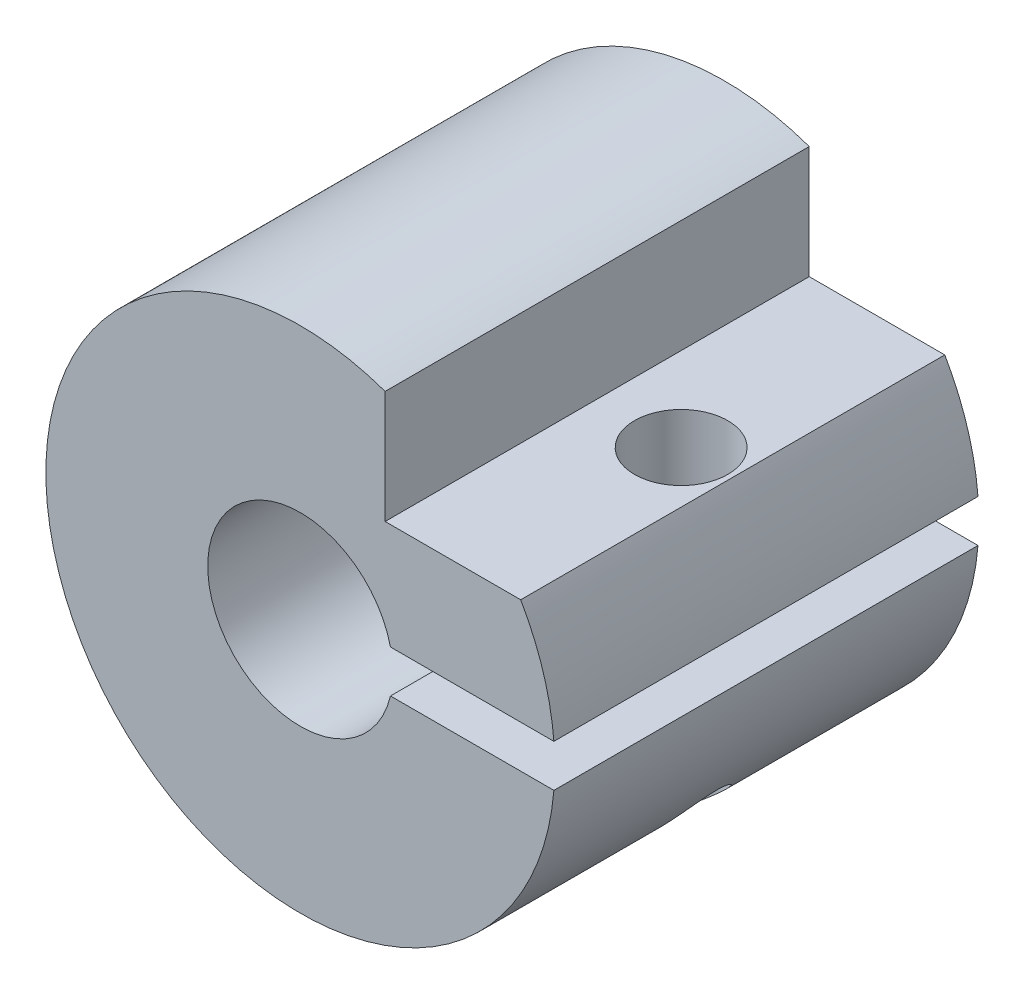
ISO-10303-21;
HEADER;
FILE_DESCRIPTION(('STEP AP214'),'2;1');
FILE_NAME('part.step','',(''),(''),'','','');
FILE_SCHEMA(('AUTOMOTIVE_DESIGN { 1 0 10303 214 1 1 1 1 }'));
ENDSEC;
DATA;
#1=APPLICATION_CONTEXT('core data for automotive mechanical design processes');
#2=APPLICATION_PROTOCOL_DEFINITION('international standard','automotive_design',2000,#1);
#3=PRODUCT_CONTEXT('',#1,'mechanical');
#4=PRODUCT('Part','Part','',(#3));
#5=PRODUCT_RELATED_PRODUCT_CATEGORY('part','',(#4));
#6=PRODUCT_DEFINITION_FORMATION('','',#4);
#7=PRODUCT_DEFINITION_CONTEXT('part definition',#1,'design');
#8=PRODUCT_DEFINITION('design','',#6,#7);
#9=PRODUCT_DEFINITION_SHAPE('','',#8);
#10=(LENGTH_UNIT() NAMED_UNIT(*) SI_UNIT(.MILLI.,.METRE.));
#11=(NAMED_UNIT(*) PLANE_ANGLE_UNIT() SI_UNIT($,.RADIAN.));
#12=(NAMED_UNIT(*) SI_UNIT($,.STERADIAN.) SOLID_ANGLE_UNIT());
#13=UNCERTAINTY_MEASURE_WITH_UNIT(LENGTH_MEASURE(1.E-05),#10,'distance_accuracy_value','');
#14=(GEOMETRIC_REPRESENTATION_CONTEXT(3) GLOBAL_UNCERTAINTY_ASSIGNED_CONTEXT((#13)) GLOBAL_UNIT_ASSIGNED_CONTEXT((#10,
#11,#12)) REPRESENTATION_CONTEXT('',''));
#15=CARTESIAN_POINT('',(0.,0.,0.));
#16=DIRECTION('',(0.,0.,1.));
#17=DIRECTION('',(1.,0.,0.));
#18=AXIS2_PLACEMENT_3D('',#15,#16,#17);
#19=CARTESIAN_POINT('',(19.8956518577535,2.49999999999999,25.));
#20=DIRECTION('',(0.,1.,0.));
#21=DIRECTION('',(0.,0.,1.));
#22=AXIS2_PLACEMENT_3D('',#19,#20,#21);
#23=CYLINDRICAL_SURFACE('',#22,5.5);
#24=CARTESIAN_POINT('',(19.8956518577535,15.,25.));
#25=DIRECTION('',(0.,1.,0.));
#26=DIRECTION('',(0.,0.,1.));
#27=AXIS2_PLACEMENT_3D('',#24,#25,#26);
#28=CIRCLE('',#27,5.5);
#29=CARTESIAN_POINT('',(19.8956518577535,15.,30.5));
#30=VERTEX_POINT('',#29);
#31=EDGE_CURVE('E134',#30,#30,#28,.T.);
#32=ORIENTED_EDGE('',*,*,#31,.T.);
#33=EDGE_LOOP('',(#32));
#34=FACE_BOUND('',#33,.T.);
#35=CARTESIAN_POINT('',(19.8956518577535,2.5,25.));
#36=DIRECTION('',(0.,1.,0.));
#37=DIRECTION('',(0.,0.,1.));
#38=AXIS2_PLACEMENT_3D('',#35,#36,#37);
#39=CIRCLE('',#38,5.5);
#40=CARTESIAN_POINT('',(19.8956518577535,2.5,30.5));
#41=VERTEX_POINT('',#40);
#42=EDGE_CURVE('E21',#41,#41,#39,.F.);
#43=ORIENTED_EDGE('',*,*,#42,.T.);
#44=EDGE_LOOP('',(#43));
#45=FACE_BOUND('',#44,.T.);
#46=ADVANCED_FACE('F16',(#34,#45),#23,.F.);
#47=CARTESIAN_POINT('',(0.,0.,0.));
#48=DIRECTION('',(0.,0.,1.));
#49=DIRECTION('',(1.,0.,0.));
#50=AXIS2_PLACEMENT_3D('',#47,#48,#49);
#51=CYLINDRICAL_SURFACE('',#50,30.);
#52=DIRECTION('',(0.,0.,1.));
#53=VECTOR('',#52,1.);
#54=CARTESIAN_POINT('',(29.8956518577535,2.5,50.));
#55=LINE('',#54,#53);
#56=CARTESIAN_POINT('',(29.8956518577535,2.5,50.));
#57=VERTEX_POINT('',#56);
#58=CARTESIAN_POINT('',(29.8956518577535,2.5,0.));
#59=VERTEX_POINT('',#58);
#60=EDGE_CURVE('E143',#57,#59,#55,.F.);
#61=ORIENTED_EDGE('',*,*,#60,.T.);
#62=CARTESIAN_POINT('',(0.,0.,0.));
#63=DIRECTION('',(0.,0.,1.));
#64=DIRECTION('',(1.,0.,0.));
#65=AXIS2_PLACEMENT_3D('',#62,#63,#64);
#66=CIRCLE('',#65,30.);
#67=CARTESIAN_POINT('',(25.9807621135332,15.,0.));
#68=VERTEX_POINT('',#67);
#69=EDGE_CURVE('E96',#68,#59,#66,.F.);
#70=ORIENTED_EDGE('',*,*,#69,.F.);
#71=DIRECTION('',(0.,0.,-1.));
#72=VECTOR('',#71,1.);
#73=CARTESIAN_POINT('',(25.9807621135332,15.,50.));
#74=LINE('',#73,#72);
#75=CARTESIAN_POINT('',(25.9807621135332,15.,50.));
#76=VERTEX_POINT('',#75);
#77=EDGE_CURVE('E73',#68,#76,#74,.F.);
#78=ORIENTED_EDGE('',*,*,#77,.T.);
#79=CARTESIAN_POINT('',(0.,0.,50.));
#80=DIRECTION('',(0.,0.,1.));
#81=DIRECTION('',(1.,0.,0.));
#82=AXIS2_PLACEMENT_3D('',#79,#80,#81);
#83=CIRCLE('',#82,30.);
#84=EDGE_CURVE('E130',#76,#57,#83,.F.);
#85=ORIENTED_EDGE('',*,*,#84,.T.);
#86=EDGE_LOOP('',(#61,#70,#78,#85));
#87=FACE_BOUND('',#86,.T.);
#88=ADVANCED_FACE('F158',(#87),#51,.T.);
#89=CARTESIAN_POINT('',(33.4642897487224,2.5,50.));
#90=DIRECTION('',(0.,1.,0.));
#91=DIRECTION('',(0.,0.,1.));
#92=AXIS2_PLACEMENT_3D('',#89,#90,#91);
#93=PLANE('',#92);
#94=ORIENTED_EDGE('',*,*,#42,.F.);
#95=EDGE_LOOP('',(#94));
#96=FACE_BOUND('',#95,.T.);
#97=DIRECTION('',(-1.,0.,0.));
#98=VECTOR('',#97,1.);
#99=CARTESIAN_POINT('',(0.,2.5,0.));
#100=LINE('',#99,#98);
#101=CARTESIAN_POINT('',(10.6274082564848,2.5,0.));
#102=VERTEX_POINT('',#101);
#103=EDGE_CURVE('E108',#59,#102,#100,.T.);
#104=ORIENTED_EDGE('',*,*,#103,.F.);
#105=ORIENTED_EDGE('',*,*,#60,.F.);
#106=DIRECTION('',(-1.,0.,0.));
#107=VECTOR('',#106,1.);
#108=CARTESIAN_POINT('',(0.,2.5,50.));
#109=LINE('',#108,#107);
#110=CARTESIAN_POINT('',(10.6274082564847,2.5,50.));
#111=VERTEX_POINT('',#110);
#112=EDGE_CURVE('E127',#57,#111,#109,.T.);
#113=ORIENTED_EDGE('',*,*,#112,.T.);
#114=DIRECTION('',(0.,0.,-1.));
#115=VECTOR('',#114,1.);
#116=CARTESIAN_POINT('',(10.6274082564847,2.5,25.));
#117=LINE('',#116,#115);
#118=EDGE_CURVE('E89',#111,#102,#117,.T.);
#119=ORIENTED_EDGE('',*,*,#118,.T.);
#120=EDGE_LOOP('',(#104,#105,#113,#119));
#121=FACE_BOUND('',#120,.T.);
#122=ADVANCED_FACE('F162',(#96,#121),#93,.F.);
#123=CARTESIAN_POINT('',(0.,0.,50.));
#124=DIRECTION('',(0.,0.,-1.));
#125=DIRECTION('',(0.,1.,0.));
#126=AXIS2_PLACEMENT_3D('',#123,#124,#125);
#127=CYLINDRICAL_SURFACE('',#126,10.9175);
#128=CARTESIAN_POINT('',(0.,0.,50.));
#129=DIRECTION('',(0.,0.,-1.));
#130=DIRECTION('',(0.,1.,0.));
#131=AXIS2_PLACEMENT_3D('',#128,#129,#130);
#132=CIRCLE('',#131,10.9175);
#133=CARTESIAN_POINT('',(10.6274082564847,-2.5,50.));
#134=VERTEX_POINT('',#133);
#135=EDGE_CURVE('E126',#111,#134,#132,.F.);
#136=ORIENTED_EDGE('',*,*,#135,.T.);
#137=DIRECTION('',(0.,0.,-1.));
#138=VECTOR('',#137,1.);
#139=CARTESIAN_POINT('',(10.6274082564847,-2.5,50.));
#140=LINE('',#139,#138);
#141=CARTESIAN_POINT('',(10.6274082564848,-2.5,0.));
#142=VERTEX_POINT('',#141);
#143=EDGE_CURVE('E106',#134,#142,#140,.T.);
#144=ORIENTED_EDGE('',*,*,#143,.T.);
#145=CARTESIAN_POINT('',(0.,0.,0.));
#146=DIRECTION('',(0.,0.,-1.));
#147=DIRECTION('',(0.,1.,0.));
#148=AXIS2_PLACEMENT_3D('',#145,#146,#147);
#149=CIRCLE('',#148,10.9175);
#150=EDGE_CURVE('E104',#102,#142,#149,.F.);
#151=ORIENTED_EDGE('',*,*,#150,.F.);
#152=ORIENTED_EDGE('',*,*,#118,.F.);
#153=EDGE_LOOP('',(#136,#144,#151,#152));
#154=FACE_BOUND('',#153,.T.);
#155=ADVANCED_FACE('F160',(#154),#127,.F.);
#156=CARTESIAN_POINT('',(9.99999999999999,30.7427259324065,50.));
#157=DIRECTION('',(-1.,0.,0.));
#158=DIRECTION('',(0.,0.,1.));
#159=AXIS2_PLACEMENT_3D('',#156,#157,#158);
#160=PLANE('',#159);
#161=DIRECTION('',(0.,1.,0.));
#162=VECTOR('',#161,1.);
#163=CARTESIAN_POINT('',(9.99999999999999,0.,50.));
#164=LINE('',#163,#162);
#165=CARTESIAN_POINT('',(9.99999999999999,28.2842712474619,50.));
#166=VERTEX_POINT('',#165);
#167=CARTESIAN_POINT('',(9.99999999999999,15.,50.));
#168=VERTEX_POINT('',#167);
#169=EDGE_CURVE('E87',#166,#168,#164,.F.);
#170=ORIENTED_EDGE('',*,*,#169,.T.);
#171=DIRECTION('',(0.,0.,-1.));
#172=VECTOR('',#171,1.);
#173=CARTESIAN_POINT('',(10.,15.,50.));
#174=LINE('',#173,#172);
#175=CARTESIAN_POINT('',(9.99999999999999,15.,0.));
#176=VERTEX_POINT('',#175);
#177=EDGE_CURVE('E81',#168,#176,#174,.T.);
#178=ORIENTED_EDGE('',*,*,#177,.T.);
#179=DIRECTION('',(0.,1.,0.));
#180=VECTOR('',#179,1.);
#181=CARTESIAN_POINT('',(9.99999999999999,0.,0.));
#182=LINE('',#181,#180);
#183=CARTESIAN_POINT('',(9.99999999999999,28.2842712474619,0.));
#184=VERTEX_POINT('',#183);
#185=EDGE_CURVE('E85',#184,#176,#182,.F.);
#186=ORIENTED_EDGE('',*,*,#185,.F.);
#187=DIRECTION('',(0.,0.,1.));
#188=VECTOR('',#187,1.);
#189=CARTESIAN_POINT('',(9.99999999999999,28.2842712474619,0.));
#190=LINE('',#189,#188);
#191=EDGE_CURVE('E97',#166,#184,#190,.F.);
#192=ORIENTED_EDGE('',*,*,#191,.F.);
#193=EDGE_LOOP('',(#170,#178,#186,#192));
#194=FACE_BOUND('',#193,.T.);
#195=ADVANCED_FACE('F82',(#194),#160,.F.);
#196=CARTESIAN_POINT('',(10.,15.,50.));
#197=DIRECTION('',(0.,-1.,0.));
#198=DIRECTION('',(0.,0.,-1.));
#199=AXIS2_PLACEMENT_3D('',#196,#197,#198);
#200=PLANE('',#199);
#201=ORIENTED_EDGE('',*,*,#31,.F.);
#202=EDGE_LOOP('',(#201));
#203=FACE_BOUND('',#202,.T.);
#204=DIRECTION('',(-1.,0.,0.));
#205=VECTOR('',#204,1.);
#206=CARTESIAN_POINT('',(0.,15.,0.));
#207=LINE('',#206,#205);
#208=EDGE_CURVE('E92',#176,#68,#207,.F.);
#209=ORIENTED_EDGE('',*,*,#208,.F.);
#210=ORIENTED_EDGE('',*,*,#177,.F.);
#211=DIRECTION('',(-1.,0.,0.));
#212=VECTOR('',#211,1.);
#213=CARTESIAN_POINT('',(0.,15.,50.));
#214=LINE('',#213,#212);
#215=EDGE_CURVE('E117',#168,#76,#214,.F.);
#216=ORIENTED_EDGE('',*,*,#215,.T.);
#217=ORIENTED_EDGE('',*,*,#77,.F.);
#218=EDGE_LOOP('',(#209,#210,#216,#217));
#219=FACE_BOUND('',#218,.T.);
#220=ADVANCED_FACE('F93',(#203,#219),#200,.F.);
#221=CARTESIAN_POINT('',(0.,0.,0.));
#222=DIRECTION('',(0.,0.,-1.));
#223=DIRECTION('',(-1.,0.,0.));
#224=AXIS2_PLACEMENT_3D('',#221,#222,#223);
#225=PLANE('',#224);
#226=CARTESIAN_POINT('',(0.,0.,0.));
#227=DIRECTION('',(0.,0.,1.));
#228=DIRECTION('',(1.,0.,0.));
#229=AXIS2_PLACEMENT_3D('',#226,#227,#228);
#230=CIRCLE('',#229,30.);
#231=CARTESIAN_POINT('',(29.8956518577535,-2.5,0.));
#232=VERTEX_POINT('',#231);
#233=EDGE_CURVE('E101',#184,#232,#230,.T.);
#234=ORIENTED_EDGE('',*,*,#233,.F.);
#235=ORIENTED_EDGE('',*,*,#185,.T.);
#236=ORIENTED_EDGE('',*,*,#208,.T.);
#237=ORIENTED_EDGE('',*,*,#69,.T.);
#238=ORIENTED_EDGE('',*,*,#103,.T.);
#239=ORIENTED_EDGE('',*,*,#150,.T.);
#240=DIRECTION('',(1.,0.,0.));
#241=VECTOR('',#240,1.);
#242=CARTESIAN_POINT('',(3.5102849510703,-2.5,0.));
#243=LINE('',#242,#241);
#244=EDGE_CURVE('E103',#142,#232,#243,.T.);
#245=ORIENTED_EDGE('',*,*,#244,.T.);
#246=EDGE_LOOP('',(#234,#235,#236,#237,#238,#239,#245));
#247=FACE_BOUND('',#246,.T.);
#248=ADVANCED_FACE('F99',(#247),#225,.T.);
#249=CARTESIAN_POINT('',(3.5102849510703,-2.5,50.));
#250=DIRECTION('',(0.,-1.,0.));
#251=DIRECTION('',(0.,0.,-1.));
#252=AXIS2_PLACEMENT_3D('',#249,#250,#251);
#253=PLANE('',#252);
#254=CARTESIAN_POINT('',(19.8956518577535,-2.5,25.));
#255=DIRECTION('',(0.,-1.,0.));
#256=DIRECTION('',(0.,0.,-1.));
#257=AXIS2_PLACEMENT_3D('',#254,#255,#256);
#258=CIRCLE('',#257,4.188);
#259=CARTESIAN_POINT('',(19.8956518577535,-2.5,20.812));
#260=VERTEX_POINT('',#259);
#261=EDGE_CURVE('E119',#260,#260,#258,.T.);
#262=ORIENTED_EDGE('',*,*,#261,.T.);
#263=EDGE_LOOP('',(#262));
#264=FACE_BOUND('',#263,.T.);
#265=DIRECTION('',(-1.,0.,0.));
#266=VECTOR('',#265,1.);
#267=CARTESIAN_POINT('',(0.,-2.5,50.));
#268=LINE('',#267,#266);
#269=CARTESIAN_POINT('',(29.8956518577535,-2.5,50.));
#270=VERTEX_POINT('',#269);
#271=EDGE_CURVE('E36',#134,#270,#268,.F.);
#272=ORIENTED_EDGE('',*,*,#271,.T.);
#273=DIRECTION('',(0.,0.,1.));
#274=VECTOR('',#273,1.);
#275=CARTESIAN_POINT('',(29.8956518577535,-2.49999999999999,0.));
#276=LINE('',#275,#274);
#277=EDGE_CURVE('E131',#232,#270,#276,.T.);
#278=ORIENTED_EDGE('',*,*,#277,.F.);
#279=ORIENTED_EDGE('',*,*,#244,.F.);
#280=ORIENTED_EDGE('',*,*,#143,.F.);
#281=EDGE_LOOP('',(#272,#278,#279,#280));
#282=FACE_BOUND('',#281,.T.);
#283=ADVANCED_FACE('F176',(#264,#282),#253,.F.);
#284=CARTESIAN_POINT('',(0.,0.,50.));
#285=DIRECTION('',(0.,0.,-1.));
#286=DIRECTION('',(-1.,0.,0.));
#287=AXIS2_PLACEMENT_3D('',#284,#285,#286);
#288=PLANE('',#287);
#289=ORIENTED_EDGE('',*,*,#169,.F.);
#290=CARTESIAN_POINT('',(0.,0.,50.));
#291=DIRECTION('',(0.,0.,1.));
#292=DIRECTION('',(1.,0.,0.));
#293=AXIS2_PLACEMENT_3D('',#290,#291,#292);
#294=CIRCLE('',#293,30.);
#295=EDGE_CURVE('E27',#270,#166,#294,.F.);
#296=ORIENTED_EDGE('',*,*,#295,.F.);
#297=ORIENTED_EDGE('',*,*,#271,.F.);
#298=ORIENTED_EDGE('',*,*,#135,.F.);
#299=ORIENTED_EDGE('',*,*,#112,.F.);
#300=ORIENTED_EDGE('',*,*,#84,.F.);
#301=ORIENTED_EDGE('',*,*,#215,.F.);
#302=EDGE_LOOP('',(#289,#296,#297,#298,#299,#300,#301));
#303=FACE_BOUND('',#302,.T.);
#304=ADVANCED_FACE('F155',(#303),#288,.F.);
#305=CARTESIAN_POINT('',(19.8956518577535,-2.5,25.));
#306=DIRECTION('',(0.,-1.,0.));
#307=DIRECTION('',(0.,0.,-1.));
#308=AXIS2_PLACEMENT_3D('',#305,#306,#307);
#309=CYLINDRICAL_SURFACE('',#308,4.188);
#310=ORIENTED_EDGE('',*,*,#261,.F.);
#311=EDGE_LOOP('',(#310));
#312=FACE_BOUND('',#311,.T.);
#313=CARTESIAN_POINT('',(15.7076518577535,-25.5591406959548,25.));
#314=CARTESIAN_POINT('',(15.7076526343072,-25.5591403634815,25.1038832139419));
#315=CARTESIAN_POINT('',(15.711523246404,-25.5567627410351,25.2077997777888));
#316=CARTESIAN_POINT('',(15.7269584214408,-25.5472671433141,25.414887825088));
#317=CARTESIAN_POINT('',(15.7385277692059,-25.5401462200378,25.5180588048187));
#318=CARTESIAN_POINT('',(15.769235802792,-25.5211976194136,25.7230450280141));
#319=CARTESIAN_POINT('',(15.7883895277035,-25.5093605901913,25.824857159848));
#320=CARTESIAN_POINT('',(15.8340145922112,-25.4810655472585,26.026211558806));
#321=CARTESIAN_POINT('',(15.860488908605,-25.4646056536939,26.125752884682));
#322=CARTESIAN_POINT('',(15.9202942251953,-25.4272583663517,26.3214774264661));
#323=CARTESIAN_POINT('',(15.9535988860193,-25.4063879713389,26.4176719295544));
#324=CARTESIAN_POINT('',(16.0267052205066,-25.3603348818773,26.6065074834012));
#325=CARTESIAN_POINT('',(16.0665093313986,-25.3351505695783,26.6991471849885));
#326=CARTESIAN_POINT('',(16.1949107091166,-25.2534187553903,26.9707483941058));
#327=CARTESIAN_POINT('',(16.2925849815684,-25.1906381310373,27.1436747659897));
#328=CARTESIAN_POINT('',(16.5125003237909,-25.0470609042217,27.4769538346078));
#329=CARTESIAN_POINT('',(16.6356329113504,-24.965593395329,27.6364190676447));
#330=CARTESIAN_POINT('',(16.8985730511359,-24.7883715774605,27.9318933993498));
#331=CARTESIAN_POINT('',(17.0383870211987,-24.6926117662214,28.067893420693));
#332=CARTESIAN_POINT('',(17.3493595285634,-24.4752987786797,28.3320749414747));
#333=CARTESIAN_POINT('',(17.5222144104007,-24.3520090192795,28.4568160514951));
#334=CARTESIAN_POINT('',(17.8774382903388,-24.0924394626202,28.6755592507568));
#335=CARTESIAN_POINT('',(18.0598153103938,-23.9561486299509,28.769534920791));
#336=CARTESIAN_POINT('',(18.3783848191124,-23.7120964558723,28.9062129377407));
#337=CARTESIAN_POINT('',(18.5135163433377,-23.6067702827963,28.9559087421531));
#338=CARTESIAN_POINT('',(18.7847617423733,-23.3915110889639,29.0404778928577));
#339=CARTESIAN_POINT('',(18.9208759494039,-23.2815764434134,29.0753459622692));
#340=CARTESIAN_POINT('',(19.3290340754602,-22.9458481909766,29.1587754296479));
#341=CARTESIAN_POINT('',(19.6008576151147,-22.7141576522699,29.1861473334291));
#342=CARTESIAN_POINT('',(20.0036106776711,-22.3581883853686,29.1888028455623));
#343=CARTESIAN_POINT('',(20.1379075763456,-22.2372934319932,29.18311858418));
#344=CARTESIAN_POINT('',(20.4037001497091,-21.9936690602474,29.1592084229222));
#345=CARTESIAN_POINT('',(20.5351959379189,-21.8709397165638,29.1409830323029));
#346=CARTESIAN_POINT('',(20.9248335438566,-21.5006835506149,29.0681750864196));
#347=CARTESIAN_POINT('',(21.1780058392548,-21.2511945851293,28.9954608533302));
#348=CARTESIAN_POINT('',(21.5687630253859,-20.8526393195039,28.8424990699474));
#349=CARTESIAN_POINT('',(21.7120849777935,-20.7033111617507,28.776891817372));
#350=CARTESIAN_POINT('',(21.9917095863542,-20.4060349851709,28.629172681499));
#351=CARTESIAN_POINT('',(22.1280096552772,-20.2580874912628,28.547054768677));
#352=CARTESIAN_POINT('',(22.3923738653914,-19.9654808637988,28.3662064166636));
#353=CARTESIAN_POINT('',(22.5204502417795,-19.8208170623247,28.2675014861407));
#354=CARTESIAN_POINT('',(22.7673542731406,-19.5367077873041,28.0527718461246));
#355=CARTESIAN_POINT('',(22.8861890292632,-19.3972583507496,27.9367606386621));
#356=CARTESIAN_POINT('',(23.1227045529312,-19.1148426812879,27.6756507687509));
#357=CARTESIAN_POINT('',(23.2394411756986,-18.9725732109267,27.5289234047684));
#358=CARTESIAN_POINT('',(23.457049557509,-18.7028531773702,27.2119381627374));
#359=CARTESIAN_POINT('',(23.5579448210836,-18.5753807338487,27.0417158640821));
#360=CARTESIAN_POINT('',(23.7186945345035,-18.3694485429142,26.7171724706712));
#361=CARTESIAN_POINT('',(23.7826780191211,-18.2864090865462,26.5678534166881));
#362=CARTESIAN_POINT('',(23.8948241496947,-18.1396226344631,26.2544240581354));
#363=CARTESIAN_POINT('',(23.9430076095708,-18.0758502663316,26.0903335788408));
#364=CARTESIAN_POINT('',(24.0144168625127,-17.9808479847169,25.7731174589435));
#365=CARTESIAN_POINT('',(24.0401596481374,-17.9463539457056,25.6215756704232));
#366=CARTESIAN_POINT('',(24.0661364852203,-17.911483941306,25.3904537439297));
#367=CARTESIAN_POINT('',(24.0726892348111,-17.9026724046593,25.3127687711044));
#368=CARTESIAN_POINT('',(24.0814461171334,-17.8908919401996,25.1567235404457));
#369=CARTESIAN_POINT('',(24.0836518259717,-17.8879208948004,25.0783635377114));
#370=CARTESIAN_POINT('',(24.0836518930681,-17.88792085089,24.9129259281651));
#371=CARTESIAN_POINT('',(24.0809286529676,-17.8915890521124,24.8258474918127));
#372=CARTESIAN_POINT('',(24.0701232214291,-17.9061232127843,24.6526290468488));
#373=CARTESIAN_POINT('',(24.062040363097,-17.9169900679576,24.5664891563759));
#374=CARTESIAN_POINT('',(24.0407457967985,-17.9455525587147,24.3959003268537));
#375=CARTESIAN_POINT('',(24.0275282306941,-17.9632559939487,24.311453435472));
#376=CARTESIAN_POINT('',(23.9963235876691,-18.0049196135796,24.1450026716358));
#377=CARTESIAN_POINT('',(23.9783338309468,-18.0288833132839,24.0630002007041));
#378=CARTESIAN_POINT('',(23.918333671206,-18.1084976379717,23.8234843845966));
#379=CARTESIAN_POINT('',(23.8699907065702,-18.1722814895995,23.6701950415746));
#380=CARTESIAN_POINT('',(23.7596335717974,-18.3163316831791,23.3771609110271));
#381=CARTESIAN_POINT('',(23.6976135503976,-18.3966050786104,23.2374219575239));
#382=CARTESIAN_POINT('',(23.5752660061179,-18.5530263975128,22.9963884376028));
#383=CARTESIAN_POINT('',(23.5167928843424,-18.6271361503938,22.8927926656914));
#384=CARTESIAN_POINT('',(23.3936720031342,-18.7815297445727,22.6941675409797));
#385=CARTESIAN_POINT('',(23.3290209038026,-18.8618169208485,22.5991428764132));
#386=CARTESIAN_POINT('',(23.1942759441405,-19.0272692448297,22.4171191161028));
#387=CARTESIAN_POINT('',(23.1241701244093,-19.1124449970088,22.330138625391));
#388=CARTESIAN_POINT('',(22.9792768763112,-19.2864114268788,22.1640260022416));
#389=CARTESIAN_POINT('',(22.9044880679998,-19.375203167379,22.0848962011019));
#390=CARTESIAN_POINT('',(22.7148618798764,-19.5975813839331,21.8989766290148));
#391=CARTESIAN_POINT('',(22.5976184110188,-19.7327404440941,21.7965052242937));
#392=CARTESIAN_POINT('',(22.3553277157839,-20.0068196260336,21.6069181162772));
#393=CARTESIAN_POINT('',(22.230277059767,-20.1457413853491,21.5198092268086));
#394=CARTESIAN_POINT('',(21.9732049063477,-20.425827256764,21.3604956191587));
#395=CARTESIAN_POINT('',(21.8411792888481,-20.5669926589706,21.2882998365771));
#396=CARTESIAN_POINT('',(21.570985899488,-20.8502007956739,21.1587710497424));
#397=CARTESIAN_POINT('',(21.4328190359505,-20.9922433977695,21.1014358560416));
#398=CARTESIAN_POINT('',(21.1480109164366,-21.2791764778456,21.0007208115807));
#399=CARTESIAN_POINT('',(21.0012520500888,-21.4240634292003,20.9576629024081));
#400=CARTESIAN_POINT('',(20.7027607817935,-21.7126415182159,20.8876501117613));
#401=CARTESIAN_POINT('',(20.5510278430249,-21.8563325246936,20.8606969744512));
#402=CARTESIAN_POINT('',(20.2436063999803,-22.1413698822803,20.8236128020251));
#403=CARTESIAN_POINT('',(20.0879220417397,-22.2827184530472,20.8134648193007));
#404=CARTESIAN_POINT('',(19.7735847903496,-22.5621282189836,20.8108293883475));
#405=CARTESIAN_POINT('',(19.614932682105,-22.700190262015,20.8183373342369));
#406=CARTESIAN_POINT('',(19.2028933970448,-23.0512135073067,20.8619014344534));
#407=CARTESIAN_POINT('',(18.9480901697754,-23.2610197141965,20.9120252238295));
#408=CARTESIAN_POINT('',(18.4414026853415,-23.664728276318,21.0637189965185));
#409=CARTESIAN_POINT('',(18.1895149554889,-23.8586516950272,21.1652195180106));
#410=CARTESIAN_POINT('',(17.7453795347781,-24.1901435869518,21.3991681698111));
#411=CARTESIAN_POINT('',(17.5509157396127,-24.3314080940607,21.5220291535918));
#412=CARTESIAN_POINT('',(17.2711275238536,-24.5300094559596,21.7342744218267));
#413=CARTESIAN_POINT('',(17.1798113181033,-24.594019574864,21.8097216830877));
#414=CARTESIAN_POINT('',(17.0021902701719,-24.7171431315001,21.9699000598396));
#415=CARTESIAN_POINT('',(16.9158831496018,-24.7762588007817,22.0546269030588));
#416=CARTESIAN_POINT('',(16.7486251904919,-24.8896337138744,22.2340023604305));
#417=CARTESIAN_POINT('',(16.6677300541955,-24.9438440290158,22.3287340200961));
#418=CARTESIAN_POINT('',(16.5134111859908,-25.046273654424,22.5270334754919));
#419=CARTESIAN_POINT('',(16.4399834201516,-25.0944962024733,22.630596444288));
#420=CARTESIAN_POINT('',(16.3017655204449,-25.1845041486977,22.8460029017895));
#421=CARTESIAN_POINT('',(16.2369768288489,-25.2262884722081,22.9578477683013));
#422=CARTESIAN_POINT('',(16.1172554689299,-25.3029471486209,23.1889269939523));
#423=CARTESIAN_POINT('',(16.0623202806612,-25.3378232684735,23.3081594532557));
#424=CARTESIAN_POINT('',(15.9707514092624,-25.3956212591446,23.5346907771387));
#425=CARTESIAN_POINT('',(15.9326109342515,-25.4195496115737,23.6411269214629));
#426=CARTESIAN_POINT('',(15.8648409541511,-25.4619013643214,23.8577315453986));
#427=CARTESIAN_POINT('',(15.8352098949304,-25.4803257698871,23.9678993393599));
#428=CARTESIAN_POINT('',(15.7850047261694,-25.5114581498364,24.1907209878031));
#429=CARTESIAN_POINT('',(15.7644043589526,-25.5241826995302,24.3033666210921));
#430=CARTESIAN_POINT('',(15.7324864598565,-25.5438686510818,24.5304041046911));
#431=CARTESIAN_POINT('',(15.7211618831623,-25.5508344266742,24.6447945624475));
#432=CARTESIAN_POINT('',(15.7122598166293,-25.5563083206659,24.7995360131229));
#433=CARTESIAN_POINT('',(15.7105324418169,-25.5573702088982,24.8396002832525));
#434=CARTESIAN_POINT('',(15.7082283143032,-25.5587864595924,24.919774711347));
#435=CARTESIAN_POINT('',(15.7076515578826,-25.5591408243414,24.9598848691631));
#436=CARTESIAN_POINT('',(15.7076518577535,-25.5591406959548,25.));
#437=B_SPLINE_CURVE_WITH_KNOTS('',3,(#313,#314,#315,#316,#317,#318,#319,#320,#321,#322,#323,
#324,#325,#326,#327,#328,#329,#330,#331,#332,#333,#334,#335,#336,#337,#338,#339,#340,#341,#342,
#343,#344,#345,#346,#347,#348,#349,#350,#351,#352,#353,#354,#355,#356,#357,#358,#359,#360,#361,
#362,#363,#364,#365,#366,#367,#368,#369,#370,#371,#372,#373,#374,#375,#376,#377,#378,#379,#380,
#381,#382,#383,#384,#385,#386,#387,#388,#389,#390,#391,#392,#393,#394,#395,#396,#397,#398,#399,
#400,#401,#402,#403,#404,#405,#406,#407,#408,#409,#410,#411,#412,#413,#414,#415,#416,#417,#418,
#419,#420,#421,#422,#423,#424,#425,#426,#427,#428,#429,#430,#431,#432,#433,#434,#435,#436),
.UNSPECIFIED.,.T.,.F.,(4,2,2,2,2,2,2,2,2,2,2,2,2,2,2,2,2,2,2,2,2,2,2,2,2,2,2,2,2,2,2,2,2,2,2,2,
2,2,2,2,2,2,2,2,2,2,2,2,2,2,2,2,2,2,2,2,2,2,2,2,2,4),(0.,0.311608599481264,0.623411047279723,
0.935834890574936,1.24838596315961,1.55975369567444,1.87123845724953,2.49331555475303,
3.14275143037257,3.79243797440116,4.52845632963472,5.26510507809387,5.79959204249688,
6.33426906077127,7.40376382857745,7.94577117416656,8.48775651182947,9.57220285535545,
10.2229912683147,10.8740177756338,11.5240521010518,12.1735819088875,12.8779395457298,
13.5812420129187,14.126738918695,14.6715143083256,15.1415558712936,15.3766325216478,
15.6116239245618,15.8727359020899,16.1338803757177,16.3953236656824,16.6569140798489,
17.1732246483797,17.6897565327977,18.1096460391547,18.5297638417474,18.9508302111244,
19.3720212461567,19.989710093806,20.607672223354,21.2260035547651,21.8442437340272,
22.4756026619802,23.1070299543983,23.7378200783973,24.3684456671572,25.3659584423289,
26.3621261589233,27.1684073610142,27.5719078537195,27.9752233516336,28.3821981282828,
28.7889518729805,29.1957734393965,29.6024908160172,29.9487152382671,30.2948763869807,
30.6400242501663,30.9849097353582,31.1052396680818,31.2255692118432),.UNSPECIFIED.);
#438=CARTESIAN_POINT('',(15.7076518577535,-25.5591406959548,25.));
#439=VERTEX_POINT('',#438);
#440=EDGE_CURVE('E10',#439,#439,#437,.T.);
#441=ORIENTED_EDGE('',*,*,#440,.F.);
#442=EDGE_LOOP('',(#441));
#443=FACE_BOUND('',#442,.T.);
#444=ADVANCED_FACE('F18',(#312,#443),#309,.F.);
#445=CARTESIAN_POINT('',(0.,0.,0.));
#446=DIRECTION('',(0.,0.,1.));
#447=DIRECTION('',(1.,0.,0.));
#448=AXIS2_PLACEMENT_3D('',#445,#446,#447);
#449=CYLINDRICAL_SURFACE('',#448,30.);
#450=ORIENTED_EDGE('',*,*,#440,.T.);
#451=EDGE_LOOP('',(#450));
#452=FACE_BOUND('',#451,.T.);
#453=ORIENTED_EDGE('',*,*,#277,.T.);
#454=ORIENTED_EDGE('',*,*,#295,.T.);
#455=ORIENTED_EDGE('',*,*,#191,.T.);
#456=ORIENTED_EDGE('',*,*,#233,.T.);
#457=EDGE_LOOP('',(#453,#454,#455,#456));
#458=FACE_BOUND('',#457,.T.);
#459=ADVANCED_FACE('F149',(#452,#458),#449,.T.);
#460=CLOSED_SHELL('',(#46,#88,#122,#155,#195,#220,#248,#283,#304,#444,#459));
#461=MANIFOLD_SOLID_BREP('B1',#460);
#462=ADVANCED_BREP_SHAPE_REPRESENTATION('',(#18,#461),#14);
#463=SHAPE_DEFINITION_REPRESENTATION(#9,#462);
ENDSEC;
END-ISO-10303-21;
